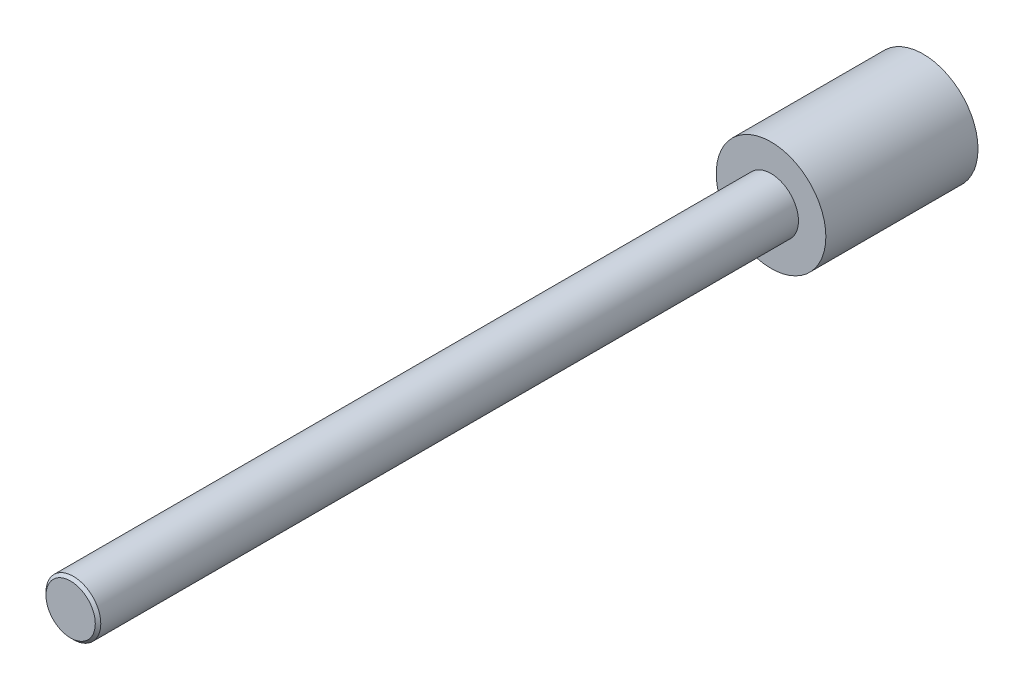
from build123d import *

# Parameters (mm, degrees)
SKETCH1_R           = 2.54
BASE_EXTRUDE_DEPTH  = 78.74
SKETCH2_R           = 5.08
BOSS_EXTRUDE1_DEPTH = 14.097
CHAMFER1_SIZE       = 0.254


with BuildPart() as part:
    # Sketch1 → Base-Extrude (new body)
    with BuildSketch(Plane.XY):
        Circle(SKETCH1_R)
    extrude(amount=BASE_EXTRUDE_DEPTH)

    # Sketch2 → Boss-Extrude1 (add)
    with BuildSketch(Plane.XY.offset(-0.254)):
        Circle(SKETCH2_R)
    extrude(amount=BOSS_EXTRUDE1_DEPTH)

    # Chamfer1
    chamfer1_edges = [part.edges().sort_by_distance(p)[0] for p in [
        (-2.54, 0, 78.74),
    ]]
    chamfer(chamfer1_edges, length=CHAMFER1_SIZE)


solid = part.part
